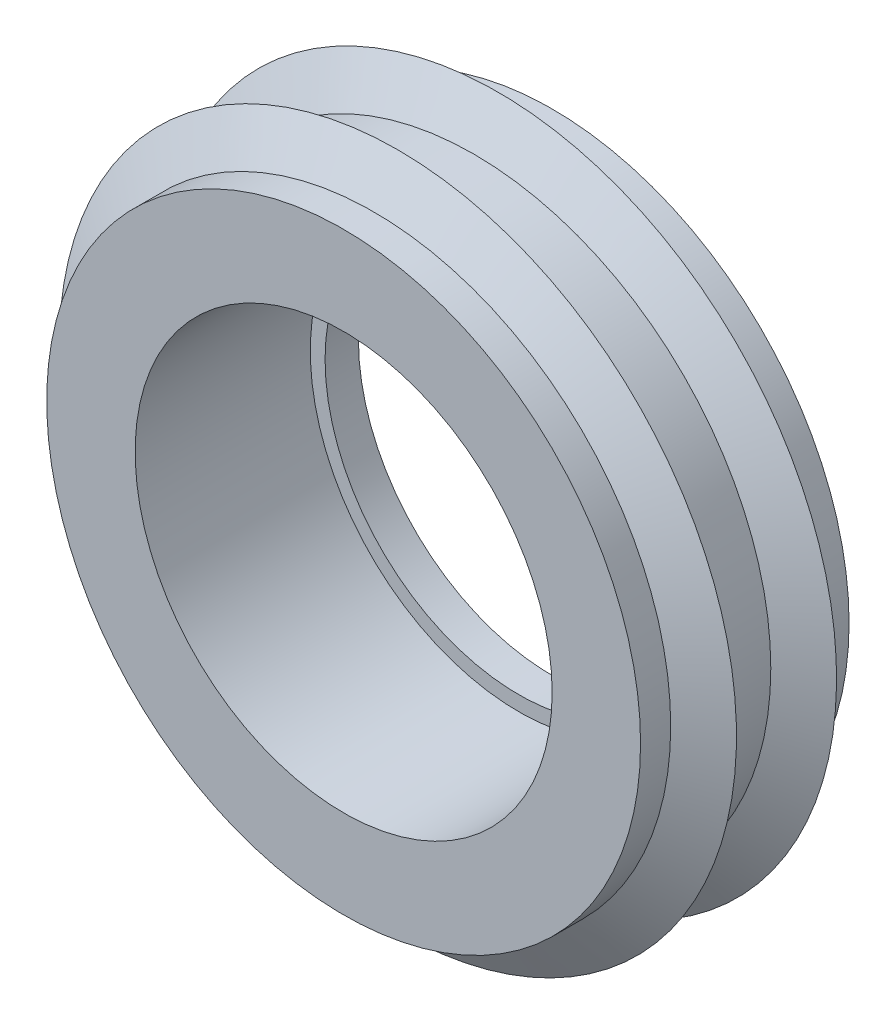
ISO-10303-21;
HEADER;
FILE_DESCRIPTION(('STEP AP214'),'2;1');
FILE_NAME('part.step','',(''),(''),'','','');
FILE_SCHEMA(('AUTOMOTIVE_DESIGN { 1 0 10303 214 1 1 1 1 }'));
ENDSEC;
DATA;
#1=APPLICATION_CONTEXT('core data for automotive mechanical design processes');
#2=APPLICATION_PROTOCOL_DEFINITION('international standard','automotive_design',2000,#1);
#3=PRODUCT_CONTEXT('',#1,'mechanical');
#4=PRODUCT('Part','Part','',(#3));
#5=PRODUCT_RELATED_PRODUCT_CATEGORY('part','',(#4));
#6=PRODUCT_DEFINITION_FORMATION('','',#4);
#7=PRODUCT_DEFINITION_CONTEXT('part definition',#1,'design');
#8=PRODUCT_DEFINITION('design','',#6,#7);
#9=PRODUCT_DEFINITION_SHAPE('','',#8);
#10=(LENGTH_UNIT() NAMED_UNIT(*) SI_UNIT(.MILLI.,.METRE.));
#11=(NAMED_UNIT(*) PLANE_ANGLE_UNIT() SI_UNIT($,.RADIAN.));
#12=(NAMED_UNIT(*) SI_UNIT($,.STERADIAN.) SOLID_ANGLE_UNIT());
#13=UNCERTAINTY_MEASURE_WITH_UNIT(LENGTH_MEASURE(1.E-05),#10,'distance_accuracy_value','');
#14=(GEOMETRIC_REPRESENTATION_CONTEXT(3) GLOBAL_UNCERTAINTY_ASSIGNED_CONTEXT((#13)) GLOBAL_UNIT_ASSIGNED_CONTEXT((#10,
#11,#12)) REPRESENTATION_CONTEXT('',''));
#15=CARTESIAN_POINT('',(0.,0.,0.));
#16=DIRECTION('',(0.,0.,1.));
#17=DIRECTION('',(1.,0.,0.));
#18=AXIS2_PLACEMENT_3D('',#15,#16,#17);
#19=CARTESIAN_POINT('',(0.,0.,3.955181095));
#20=DIRECTION('',(0.,0.,1.));
#21=DIRECTION('',(1.,0.,0.));
#22=AXIS2_PLACEMENT_3D('',#19,#20,#21);
#23=CONICAL_SURFACE('',#22,9.0424,1.04719755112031);
#24=CARTESIAN_POINT('',(0.,0.,3.955181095));
#25=DIRECTION('',(0.,0.,1.));
#26=DIRECTION('',(0.,-1.,0.));
#27=AXIS2_PLACEMENT_3D('',#24,#25,#26);
#28=CIRCLE('',#27,9.0424);
#29=CARTESIAN_POINT('',(0.,-9.0424,3.955181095));
#30=VERTEX_POINT('',#29);
#31=EDGE_CURVE('E28',#30,#30,#28,.T.);
#32=ORIENTED_EDGE('',*,*,#31,.T.);
#33=EDGE_LOOP('',(#32));
#34=FACE_BOUND('',#33,.T.);
#35=CARTESIAN_POINT('',(0.,0.,4.68841593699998));
#36=DIRECTION('',(0.,0.,-1.));
#37=DIRECTION('',(0.,1.,0.));
#38=AXIS2_PLACEMENT_3D('',#35,#36,#37);
#39=CIRCLE('',#38,10.3124);
#40=CARTESIAN_POINT('',(0.,10.3124,4.688415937));
#41=VERTEX_POINT('',#40);
#42=EDGE_CURVE('E51',#41,#41,#39,.T.);
#43=ORIENTED_EDGE('',*,*,#42,.T.);
#44=EDGE_LOOP('',(#43));
#45=FACE_BOUND('',#44,.T.);
#46=ADVANCED_FACE('F12',(#34,#45),#23,.T.);
#47=CARTESIAN_POINT('',(0.,0.,2.373650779));
#48=DIRECTION('',(0.,0.,1.));
#49=DIRECTION('',(1.,0.,0.));
#50=AXIS2_PLACEMENT_3D('',#47,#48,#49);
#51=CYLINDRICAL_SURFACE('',#50,9.0424);
#52=ORIENTED_EDGE('',*,*,#31,.F.);
#53=EDGE_LOOP('',(#52));
#54=FACE_BOUND('',#53,.T.);
#55=CARTESIAN_POINT('',(0.,0.,2.37365077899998));
#56=DIRECTION('',(0.,0.,-1.));
#57=DIRECTION('',(0.,1.,0.));
#58=AXIS2_PLACEMENT_3D('',#55,#56,#57);
#59=CIRCLE('',#58,9.0424);
#60=CARTESIAN_POINT('',(0.,9.0424,2.373650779));
#61=VERTEX_POINT('',#60);
#62=EDGE_CURVE('E49',#61,#61,#59,.F.);
#63=ORIENTED_EDGE('',*,*,#62,.T.);
#64=EDGE_LOOP('',(#63));
#65=FACE_BOUND('',#64,.T.);
#66=ADVANCED_FACE('F110',(#54,#65),#51,.T.);
#67=CARTESIAN_POINT('',(0.,0.,5.421650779));
#68=DIRECTION('',(0.,0.,-1.));
#69=DIRECTION('',(-1.,0.,0.));
#70=AXIS2_PLACEMENT_3D('',#67,#68,#69);
#71=CONICAL_SURFACE('',#70,9.0424,1.04719755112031);
#72=CARTESIAN_POINT('',(0.,0.,5.421650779));
#73=DIRECTION('',(0.,0.,1.));
#74=DIRECTION('',(0.,-1.,0.));
#75=AXIS2_PLACEMENT_3D('',#72,#73,#74);
#76=CIRCLE('',#75,9.0424);
#77=CARTESIAN_POINT('',(0.,-9.0424,5.421650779));
#78=VERTEX_POINT('',#77);
#79=EDGE_CURVE('E46',#78,#78,#76,.F.);
#80=ORIENTED_EDGE('',*,*,#79,.T.);
#81=EDGE_LOOP('',(#80));
#82=FACE_BOUND('',#81,.T.);
#83=ORIENTED_EDGE('',*,*,#42,.F.);
#84=EDGE_LOOP('',(#83));
#85=FACE_BOUND('',#84,.T.);
#86=ADVANCED_FACE('F106',(#82,#85),#71,.T.);
#87=CARTESIAN_POINT('',(0.,0.,2.373650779));
#88=DIRECTION('',(0.,0.,-1.));
#89=DIRECTION('',(-1.,0.,0.));
#90=AXIS2_PLACEMENT_3D('',#87,#88,#89);
#91=CONICAL_SURFACE('',#90,9.0424,1.04719755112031);
#92=CARTESIAN_POINT('',(0.,0.,1.64041593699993));
#93=DIRECTION('',(0.,0.,1.));
#94=DIRECTION('',(0.,-1.,0.));
#95=AXIS2_PLACEMENT_3D('',#92,#93,#94);
#96=CIRCLE('',#95,10.3124);
#97=CARTESIAN_POINT('',(0.,-10.3124,1.640415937));
#98=VERTEX_POINT('',#97);
#99=EDGE_CURVE('E39',#98,#98,#96,.T.);
#100=ORIENTED_EDGE('',*,*,#99,.T.);
#101=EDGE_LOOP('',(#100));
#102=FACE_BOUND('',#101,.T.);
#103=ORIENTED_EDGE('',*,*,#62,.F.);
#104=EDGE_LOOP('',(#103));
#105=FACE_BOUND('',#104,.T.);
#106=ADVANCED_FACE('F102',(#102,#105),#91,.T.);
#107=CARTESIAN_POINT('',(0.,0.,5.421650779));
#108=DIRECTION('',(0.,0.,1.));
#109=DIRECTION('',(1.,0.,0.));
#110=AXIS2_PLACEMENT_3D('',#107,#108,#109);
#111=CYLINDRICAL_SURFACE('',#110,9.0424);
#112=ORIENTED_EDGE('',*,*,#79,.F.);
#113=EDGE_LOOP('',(#112));
#114=FACE_BOUND('',#113,.T.);
#115=CARTESIAN_POINT('',(0.,0.,6.339415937));
#116=DIRECTION('',(0.,0.,1.));
#117=DIRECTION('',(1.,0.,0.));
#118=AXIS2_PLACEMENT_3D('',#115,#116,#117);
#119=CIRCLE('',#118,9.0424);
#120=CARTESIAN_POINT('',(9.0424,0.,6.339415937));
#121=VERTEX_POINT('',#120);
#122=EDGE_CURVE('E16',#121,#121,#119,.F.);
#123=ORIENTED_EDGE('',*,*,#122,.T.);
#124=EDGE_LOOP('',(#123));
#125=FACE_BOUND('',#124,.T.);
#126=ADVANCED_FACE('F98',(#114,#125),#111,.T.);
#127=CARTESIAN_POINT('',(0.,0.,0.907181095));
#128=DIRECTION('',(0.,0.,1.));
#129=DIRECTION('',(1.,0.,0.));
#130=AXIS2_PLACEMENT_3D('',#127,#128,#129);
#131=CONICAL_SURFACE('',#130,9.0424,1.04719755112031);
#132=ORIENTED_EDGE('',*,*,#99,.F.);
#133=EDGE_LOOP('',(#132));
#134=FACE_BOUND('',#133,.T.);
#135=CARTESIAN_POINT('',(0.,0.,0.907181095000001));
#136=DIRECTION('',(0.,0.,1.));
#137=DIRECTION('',(0.,-1.,0.));
#138=AXIS2_PLACEMENT_3D('',#135,#136,#137);
#139=CIRCLE('',#138,9.0424);
#140=CARTESIAN_POINT('',(0.,-9.0424,0.907181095));
#141=VERTEX_POINT('',#140);
#142=EDGE_CURVE('E31',#141,#141,#139,.T.);
#143=ORIENTED_EDGE('',*,*,#142,.T.);
#144=EDGE_LOOP('',(#143));
#145=FACE_BOUND('',#144,.T.);
#146=ADVANCED_FACE('F90',(#134,#145),#131,.T.);
#147=CARTESIAN_POINT('',(-9.1509088,-9.15060804,6.339415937));
#148=DIRECTION('',(0.,0.,-1.));
#149=DIRECTION('',(0.,1.,0.));
#150=AXIS2_PLACEMENT_3D('',#147,#148,#149);
#151=PLANE('',#150);
#152=CARTESIAN_POINT('',(0.,0.,6.339415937));
#153=DIRECTION('',(0.,0.,1.));
#154=DIRECTION('',(1.,0.,0.));
#155=AXIS2_PLACEMENT_3D('',#152,#153,#154);
#156=CIRCLE('',#155,6.35);
#157=CARTESIAN_POINT('',(6.35,0.,6.339415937));
#158=VERTEX_POINT('',#157);
#159=EDGE_CURVE('E25',#158,#158,#156,.T.);
#160=ORIENTED_EDGE('',*,*,#159,.F.);
#161=EDGE_LOOP('',(#160));
#162=FACE_BOUND('',#161,.T.);
#163=ORIENTED_EDGE('',*,*,#122,.F.);
#164=EDGE_LOOP('',(#163));
#165=FACE_BOUND('',#164,.T.);
#166=ADVANCED_FACE('F88',(#162,#165),#151,.F.);
#167=CARTESIAN_POINT('',(0.,0.,-0.010584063));
#168=DIRECTION('',(0.,0.,1.));
#169=DIRECTION('',(1.,0.,0.));
#170=AXIS2_PLACEMENT_3D('',#167,#168,#169);
#171=CYLINDRICAL_SURFACE('',#170,9.0424);
#172=ORIENTED_EDGE('',*,*,#142,.F.);
#173=EDGE_LOOP('',(#172));
#174=FACE_BOUND('',#173,.T.);
#175=CARTESIAN_POINT('',(0.,0.,-0.0105840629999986));
#176=DIRECTION('',(0.,0.,1.));
#177=DIRECTION('',(1.,0.,0.));
#178=AXIS2_PLACEMENT_3D('',#175,#176,#177);
#179=CIRCLE('',#178,9.0424);
#180=CARTESIAN_POINT('',(9.0424,0.,-0.0105840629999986));
#181=VERTEX_POINT('',#180);
#182=EDGE_CURVE('E20',#181,#181,#179,.T.);
#183=ORIENTED_EDGE('',*,*,#182,.T.);
#184=EDGE_LOOP('',(#183));
#185=FACE_BOUND('',#184,.T.);
#186=ADVANCED_FACE('F83',(#174,#185),#171,.T.);
#187=CARTESIAN_POINT('',(0.,0.,1.005415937));
#188=DIRECTION('',(0.,0.,1.));
#189=DIRECTION('',(1.,0.,0.));
#190=AXIS2_PLACEMENT_3D('',#187,#188,#189);
#191=CYLINDRICAL_SURFACE('',#190,6.35);
#192=CARTESIAN_POINT('',(0.,0.,1.005415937));
#193=DIRECTION('',(0.,0.,1.));
#194=DIRECTION('',(1.,0.,0.));
#195=AXIS2_PLACEMENT_3D('',#192,#193,#194);
#196=CIRCLE('',#195,6.35);
#197=CARTESIAN_POINT('',(6.35,0.,1.005415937));
#198=VERTEX_POINT('',#197);
#199=EDGE_CURVE('E8',#198,#198,#196,.F.);
#200=ORIENTED_EDGE('',*,*,#199,.T.);
#201=EDGE_LOOP('',(#200));
#202=FACE_BOUND('',#201,.T.);
#203=ORIENTED_EDGE('',*,*,#159,.T.);
#204=EDGE_LOOP('',(#203));
#205=FACE_BOUND('',#204,.T.);
#206=ADVANCED_FACE('F77',(#202,#205),#191,.F.);
#207=CARTESIAN_POINT('',(-9.1509088,9.1509088,-0.010584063));
#208=DIRECTION('',(0.,0.,1.));
#209=DIRECTION('',(0.,-1.,0.));
#210=AXIS2_PLACEMENT_3D('',#207,#208,#209);
#211=PLANE('',#210);
#212=ORIENTED_EDGE('',*,*,#182,.F.);
#213=EDGE_LOOP('',(#212));
#214=FACE_BOUND('',#213,.T.);
#215=CARTESIAN_POINT('',(0.,0.,-0.0105840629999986));
#216=DIRECTION('',(0.,0.,1.));
#217=DIRECTION('',(1.,0.,0.));
#218=AXIS2_PLACEMENT_3D('',#215,#216,#217);
#219=CIRCLE('',#218,5.9);
#220=CARTESIAN_POINT('',(5.9,0.,-0.0105840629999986));
#221=VERTEX_POINT('',#220);
#222=EDGE_CURVE('E42',#221,#221,#219,.F.);
#223=ORIENTED_EDGE('',*,*,#222,.F.);
#224=EDGE_LOOP('',(#223));
#225=FACE_BOUND('',#224,.T.);
#226=ADVANCED_FACE('F68',(#214,#225),#211,.F.);
#227=CARTESIAN_POINT('',(-6.4262,-6.4262,1.005415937));
#228=DIRECTION('',(0.,0.,-1.));
#229=DIRECTION('',(0.,1.,0.));
#230=AXIS2_PLACEMENT_3D('',#227,#228,#229);
#231=PLANE('',#230);
#232=ORIENTED_EDGE('',*,*,#199,.F.);
#233=EDGE_LOOP('',(#232));
#234=FACE_BOUND('',#233,.T.);
#235=CARTESIAN_POINT('',(0.,0.,1.005415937));
#236=DIRECTION('',(0.,0.,1.));
#237=DIRECTION('',(1.,0.,0.));
#238=AXIS2_PLACEMENT_3D('',#235,#236,#237);
#239=CIRCLE('',#238,5.9);
#240=CARTESIAN_POINT('',(5.9,0.,1.005415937));
#241=VERTEX_POINT('',#240);
#242=EDGE_CURVE('E59',#241,#241,#239,.T.);
#243=ORIENTED_EDGE('',*,*,#242,.F.);
#244=EDGE_LOOP('',(#243));
#245=FACE_BOUND('',#244,.T.);
#246=ADVANCED_FACE('F14',(#234,#245),#231,.F.);
#247=CARTESIAN_POINT('',(0.,0.,-17.9710963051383));
#248=DIRECTION('',(0.,0.,1.));
#249=DIRECTION('',(1.,0.,0.));
#250=AXIS2_PLACEMENT_3D('',#247,#248,#249);
#251=CYLINDRICAL_SURFACE('',#250,5.9);
#252=ORIENTED_EDGE('',*,*,#222,.T.);
#253=EDGE_LOOP('',(#252));
#254=FACE_BOUND('',#253,.T.);
#255=ORIENTED_EDGE('',*,*,#242,.T.);
#256=EDGE_LOOP('',(#255));
#257=FACE_BOUND('',#256,.T.);
#258=ADVANCED_FACE('F65',(#254,#257),#251,.F.);
#259=CLOSED_SHELL('',(#46,#66,#86,#106,#126,#146,#166,#186,#206,#226,#246,#258));
#260=MANIFOLD_SOLID_BREP('B1',#259);
#261=ADVANCED_BREP_SHAPE_REPRESENTATION('',(#18,#260),#14);
#262=SHAPE_DEFINITION_REPRESENTATION(#9,#261);
ENDSEC;
END-ISO-10303-21;
